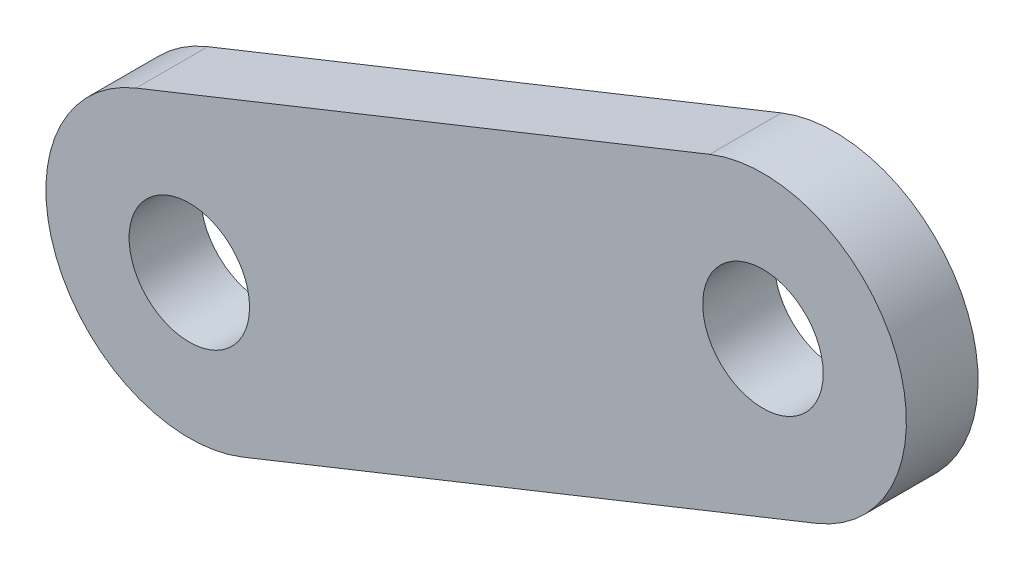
from build123d import *

# Parameters (mm, degrees)
SK_BIELA_EXTERIOR_R  = 2.1
BIELA_EXTERIOR_DEPTH = 2.5


with BuildPart() as part:
    # Sk_Biela_exterior → Biela_exterior (new body)
    with BuildSketch(Plane.XY.offset(66.4)):
        with BuildLine():
            Line((-38.143046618, -40.642383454), (-18.143046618, -32.642383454))
            ThreePointArc((-18.143046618, -32.642383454), (-15.357616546, -26.143046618), (-21.856953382, -23.357616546))
            Line((-21.856953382, -23.357616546), (-41.856953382, -31.357616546))
            ThreePointArc((-41.856953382, -31.357616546), (-44.642383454, -37.856953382), (-38.143046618, -40.642383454))
        make_face()
        with Locations((-20, -28)):
            Circle(SK_BIELA_EXTERIOR_R, mode=Mode.SUBTRACT)
        with Locations((-40, -36)):
            Circle(SK_BIELA_EXTERIOR_R, mode=Mode.SUBTRACT)
    extrude(amount=BIELA_EXTERIOR_DEPTH)


solid = part.part
